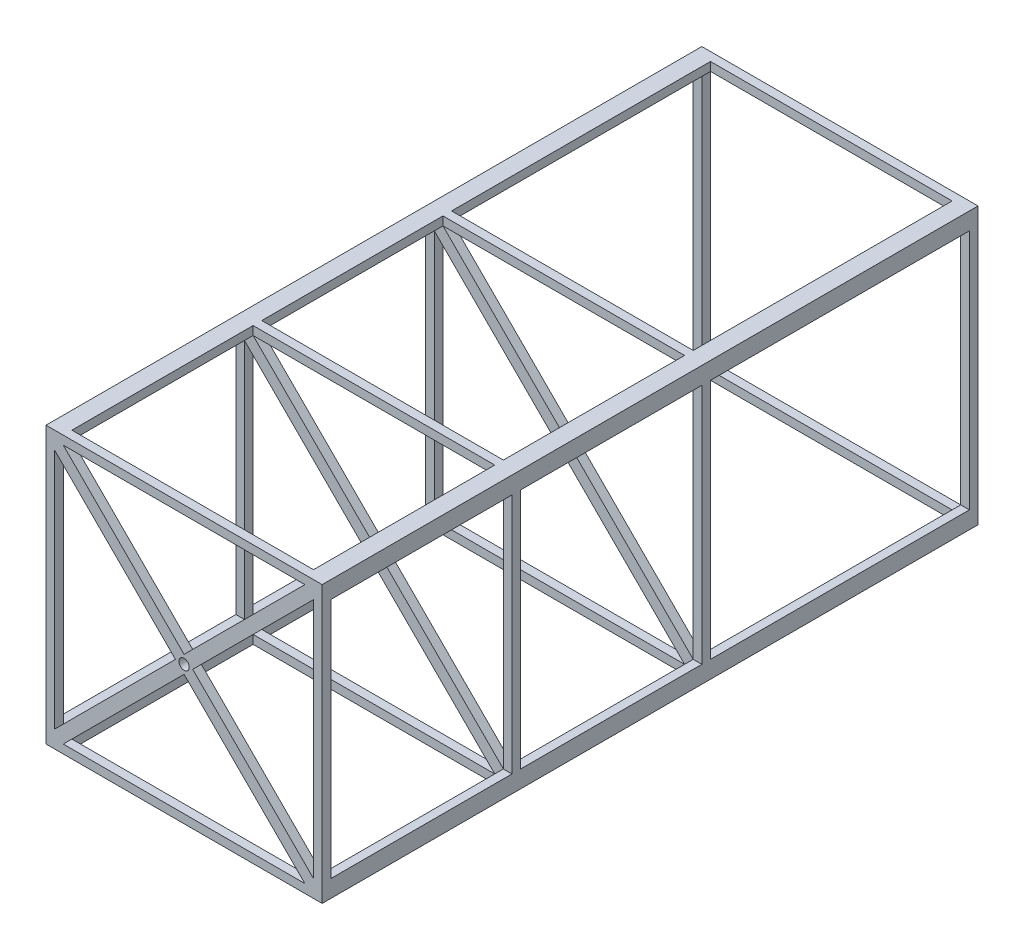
from build123d import *

# Parameters (mm, degrees)
BOSS_EXTRUDE1_START     = 105
SKETCH1_W               = 5
SKETCH1_H               = 5
BOSS_EXTRUDE1_DEPTH     = 5
LPATTERN1_COUNT         = 3
LPATTERN1_PITCH         = 110
BOSS_EXTRUDE8_DEPTH     = 375
SKETCH9_W               = 160
SKETCH9_H               = 160
BOSS_EXTRUDE9_DEPTH     = 5
CUT_EXTRUDE2_DEPTH      = 320.100297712
CUT_EXTRUDE2_DEPTH_BACK = 320.100297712
SKETCH10_R              = 3


with BuildPart() as part:
    # Sketch1 → Boss-Extrude1 (new body)
    with BuildSketch(Plane.XY.offset(BOSS_EXTRUDE1_START)):
        with Locations((2.5, 157.5)):
            Rectangle(SKETCH1_W, SKETCH1_H)
        Polygon((5, 160), (5, 155), (10, 155), align=None)
        Polygon((155, 160), (5, 160), (10, 155), (150, 155), align=None)
        Polygon((155, 155), (155, 160), (150, 155), align=None)
        Polygon((155, 150), (160, 155), (155, 155), align=None)
        Polygon((155, 10), (160, 5), (160, 155), (155, 150), align=None)
        with Locations((157.5, 157.5)):
            Rectangle(SKETCH1_W, SKETCH1_H)
        Polygon((155, 10), (155, 5), (160, 5), align=None)
        Polygon((150, 5), (155, 0), (155, 5), align=None)
        with Locations((157.5, 2.5)):
            Rectangle(SKETCH1_W, SKETCH1_H)
        Polygon((150, 5), (155, 5), (155, 10), (85, 80), (80, 75), align=None)
        Polygon((10, 5), (5, 0), (155, 0), (150, 5), align=None)
        with Locations((2.5, 2.5)):
            Rectangle(SKETCH1_W, SKETCH1_H)
        Polygon((5, 5), (5, 0), (10, 5), align=None)
        Polygon((5, 10), (0, 5), (5, 5), align=None)
        Polygon((5, 10), (5, 5), (10, 5), (80, 75), (75, 80), align=None)
        Polygon((0, 155), (0, 5), (5, 10), (5, 150), align=None)
        Polygon((5, 155), (0, 155), (5, 150), align=None)
        Polygon((10, 155), (5, 155), (5, 150), (75, 80), (80, 85), align=None)
        Polygon((150, 155), (80, 85), (85, 80), (155, 150), (155, 155), align=None)
        Polygon((80, 85), (75, 80), (80, 75), (85, 80), align=None)
    extrude(amount=BOSS_EXTRUDE1_DEPTH)


with BuildPart() as lpattern1_1:
    # LPattern1: pattern copy
    add(part.part.moved(Location(Vector(0, 0, 1) * (1 * LPATTERN1_PITCH))))


with BuildPart() as lpattern1_2:
    # LPattern1: pattern copy
    add(part.part.moved(Location(Vector(0, 0, 1) * (2 * LPATTERN1_PITCH))))


with BuildPart() as part_1:
    add(part.part)

    add(lpattern1_1.part)  # Boss-Extrude8 merges LPattern1_1

    add(lpattern1_2.part)  # Boss-Extrude8 merges LPattern1_2
    # Sketch8 → Boss-Extrude8 (add)
    with BuildSketch(Plane.XY.offset(330)):
        Polygon((0, 160), (0, 150), (5, 150), (10, 155), (10, 160), align=None)
        Polygon((10, 5), (10, 0), (0, 0), (0, 10), (5, 10), align=None)
        Polygon((150, 5), (155, 10), (160, 10), (160, 0), (150, 0), align=None)
        Polygon((160, 160), (150, 160), (150, 155), (155, 150), (160, 150), align=None)
    extrude(amount=-BOSS_EXTRUDE8_DEPTH)

    # Sketch9 → Boss-Extrude9 (add)
    with BuildSketch(Plane(origin=(0, 0, -45), x_dir=(-1, 0, 0), z_dir=(0, 0, -1))):
        with Locations((-80, 80)):
            Rectangle(SKETCH9_W, SKETCH9_H)
        Polygon((-155, 150), (-150, 155), (-10, 155), (-5, 150), (-5, 10), (-10, 5), (-150, 5), (-155, 10), align=None, mode=Mode.SUBTRACT)
    extrude(amount=BOSS_EXTRUDE9_DEPTH)

    # Sketch10 → Cut-Extrude2 (cut, two sides: drawn at the far end of the back side and taken through both)
    with BuildSketch(Plane(origin=(0, 0, 105), x_dir=(-1, 0, 0), z_dir=(0, 0, -1)).offset(-CUT_EXTRUDE2_DEPTH_BACK)):
        with Locations((-80, 80)):
            Circle(SKETCH10_R)
    extrude(amount=CUT_EXTRUDE2_DEPTH + CUT_EXTRUDE2_DEPTH_BACK, mode=Mode.SUBTRACT)


solid = part_1.part
